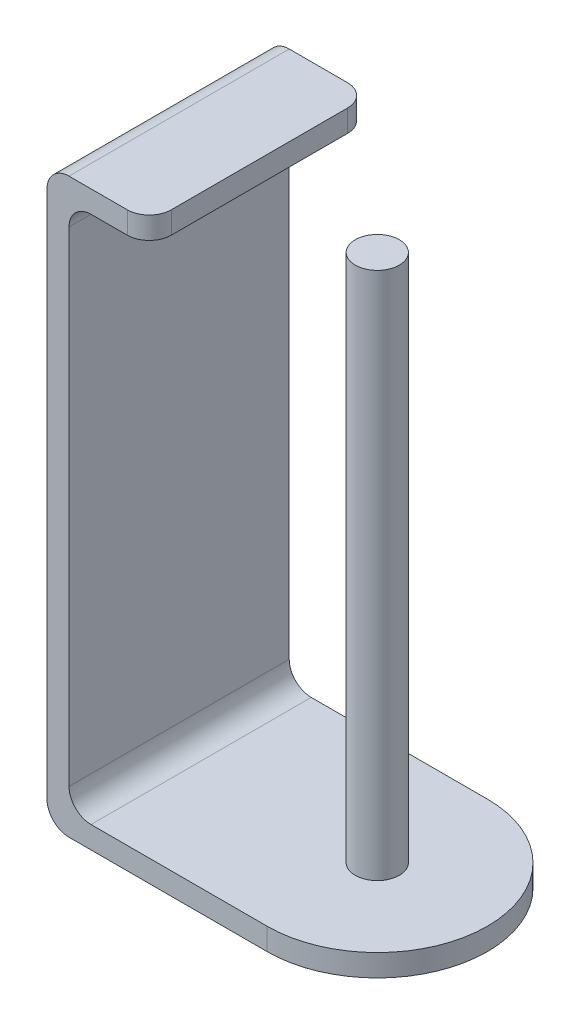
ISO-10303-21;
HEADER;
FILE_DESCRIPTION(('STEP AP214'),'2;1');
FILE_NAME('part.step','',(''),(''),'','','');
FILE_SCHEMA(('AUTOMOTIVE_DESIGN { 1 0 10303 214 1 1 1 1 }'));
ENDSEC;
DATA;
#1=APPLICATION_CONTEXT('core data for automotive mechanical design processes');
#2=APPLICATION_PROTOCOL_DEFINITION('international standard','automotive_design',2000,#1);
#3=PRODUCT_CONTEXT('',#1,'mechanical');
#4=PRODUCT('Part','Part','',(#3));
#5=PRODUCT_RELATED_PRODUCT_CATEGORY('part','',(#4));
#6=PRODUCT_DEFINITION_FORMATION('','',#4);
#7=PRODUCT_DEFINITION_CONTEXT('part definition',#1,'design');
#8=PRODUCT_DEFINITION('design','',#6,#7);
#9=PRODUCT_DEFINITION_SHAPE('','',#8);
#10=(LENGTH_UNIT() NAMED_UNIT(*) SI_UNIT(.MILLI.,.METRE.));
#11=(NAMED_UNIT(*) PLANE_ANGLE_UNIT() SI_UNIT($,.RADIAN.));
#12=(NAMED_UNIT(*) SI_UNIT($,.STERADIAN.) SOLID_ANGLE_UNIT());
#13=UNCERTAINTY_MEASURE_WITH_UNIT(LENGTH_MEASURE(1.E-05),#10,'distance_accuracy_value','');
#14=(GEOMETRIC_REPRESENTATION_CONTEXT(3) GLOBAL_UNCERTAINTY_ASSIGNED_CONTEXT((#13)) GLOBAL_UNIT_ASSIGNED_CONTEXT((#10,
#11,#12)) REPRESENTATION_CONTEXT('',''));
#15=CARTESIAN_POINT('',(0.,0.,0.));
#16=DIRECTION('',(0.,0.,1.));
#17=DIRECTION('',(1.,0.,0.));
#18=AXIS2_PLACEMENT_3D('',#15,#16,#17);
#19=CARTESIAN_POINT('',(127.,12.7,0.));
#20=DIRECTION('',(0.,1.,0.));
#21=DIRECTION('',(0.,0.,1.));
#22=AXIS2_PLACEMENT_3D('',#19,#20,#21);
#23=PLANE('',#22);
#24=DIRECTION('',(-1.,0.,0.));
#25=VECTOR('',#24,1.);
#26=CARTESIAN_POINT('',(127.,12.7,-63.5));
#27=LINE('',#26,#25);
#28=CARTESIAN_POINT('',(127.,12.7,-63.5));
#29=VERTEX_POINT('',#28);
#30=CARTESIAN_POINT('',(25.4,12.7,-63.5));
#31=VERTEX_POINT('',#30);
#32=EDGE_CURVE('E156',#29,#31,#27,.T.);
#33=ORIENTED_EDGE('',*,*,#32,.T.);
#34=DIRECTION('',(0.,0.,-1.));
#35=VECTOR('',#34,1.);
#36=CARTESIAN_POINT('',(25.4,12.7,0.));
#37=LINE('',#36,#35);
#38=CARTESIAN_POINT('',(25.4,12.7,63.5));
#39=VERTEX_POINT('',#38);
#40=EDGE_CURVE('E183',#31,#39,#37,.F.);
#41=ORIENTED_EDGE('',*,*,#40,.T.);
#42=DIRECTION('',(1.,0.,0.));
#43=VECTOR('',#42,1.);
#44=CARTESIAN_POINT('',(0.,12.7,63.5));
#45=LINE('',#44,#43);
#46=CARTESIAN_POINT('',(127.,12.7,63.5));
#47=VERTEX_POINT('',#46);
#48=EDGE_CURVE('E210',#39,#47,#45,.T.);
#49=ORIENTED_EDGE('',*,*,#48,.T.);
#50=CARTESIAN_POINT('',(127.,12.7,0.));
#51=DIRECTION('',(0.,1.,0.));
#52=DIRECTION('',(0.,0.,1.));
#53=AXIS2_PLACEMENT_3D('',#50,#51,#52);
#54=CIRCLE('',#53,63.5);
#55=EDGE_CURVE('E145',#47,#29,#54,.T.);
#56=ORIENTED_EDGE('',*,*,#55,.T.);
#57=EDGE_LOOP('',(#33,#41,#49,#56));
#58=FACE_BOUND('',#57,.T.);
#59=CARTESIAN_POINT('',(127.,12.7,0.));
#60=DIRECTION('',(0.,1.,0.));
#61=DIRECTION('',(0.,0.,1.));
#62=AXIS2_PLACEMENT_3D('',#59,#60,#61);
#63=CIRCLE('',#62,12.7);
#64=CARTESIAN_POINT('',(127.,12.7,12.7));
#65=VERTEX_POINT('',#64);
#66=EDGE_CURVE('E256',#65,#65,#63,.T.);
#67=ORIENTED_EDGE('',*,*,#66,.F.);
#68=EDGE_LOOP('',(#67));
#69=FACE_BOUND('',#68,.T.);
#70=ADVANCED_FACE('F24',(#58,#69),#23,.T.);
#71=CARTESIAN_POINT('',(0.,12.7,63.5));
#72=DIRECTION('',(0.,0.,-1.));
#73=DIRECTION('',(-1.,0.,0.));
#74=AXIS2_PLACEMENT_3D('',#71,#72,#73);
#75=PLANE('',#74);
#76=DIRECTION('',(0.,-1.,0.));
#77=VECTOR('',#76,1.);
#78=CARTESIAN_POINT('',(0.,12.7,63.5));
#79=LINE('',#78,#77);
#80=CARTESIAN_POINT('',(0.,317.5,63.5));
#81=VERTEX_POINT('',#80);
#82=CARTESIAN_POINT('',(0.,12.7,63.5));
#83=VERTEX_POINT('',#82);
#84=EDGE_CURVE('E160',#81,#83,#79,.T.);
#85=ORIENTED_EDGE('',*,*,#84,.T.);
#86=CARTESIAN_POINT('',(12.7,12.7,63.5));
#87=DIRECTION('',(0.,0.,-1.));
#88=DIRECTION('',(-1.,0.,0.));
#89=AXIS2_PLACEMENT_3D('',#86,#87,#88);
#90=CIRCLE('',#89,12.7);
#91=CARTESIAN_POINT('',(12.7,0.,63.5));
#92=VERTEX_POINT('',#91);
#93=EDGE_CURVE('E133',#83,#92,#90,.F.);
#94=ORIENTED_EDGE('',*,*,#93,.T.);
#95=DIRECTION('',(1.,0.,0.));
#96=VECTOR('',#95,1.);
#97=CARTESIAN_POINT('',(0.,0.,63.5));
#98=LINE('',#97,#96);
#99=CARTESIAN_POINT('',(127.,0.,63.5));
#100=VERTEX_POINT('',#99);
#101=EDGE_CURVE('E127',#92,#100,#98,.T.);
#102=ORIENTED_EDGE('',*,*,#101,.T.);
#103=DIRECTION('',(0.,-1.,0.));
#104=VECTOR('',#103,1.);
#105=CARTESIAN_POINT('',(127.,12.7,63.5));
#106=LINE('',#105,#104);
#107=EDGE_CURVE('E132',#47,#100,#106,.T.);
#108=ORIENTED_EDGE('',*,*,#107,.F.);
#109=ORIENTED_EDGE('',*,*,#48,.F.);
#110=CARTESIAN_POINT('',(25.4,25.4,63.5));
#111=DIRECTION('',(0.,0.,-1.));
#112=DIRECTION('',(-1.,0.,0.));
#113=AXIS2_PLACEMENT_3D('',#110,#111,#112);
#114=CIRCLE('',#113,12.7);
#115=CARTESIAN_POINT('',(12.7,25.4000000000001,63.5));
#116=VERTEX_POINT('',#115);
#117=EDGE_CURVE('E11',#39,#116,#114,.T.);
#118=ORIENTED_EDGE('',*,*,#117,.T.);
#119=DIRECTION('',(0.,-1.,0.));
#120=VECTOR('',#119,1.);
#121=CARTESIAN_POINT('',(12.7,317.5,63.5));
#122=LINE('',#121,#120);
#123=CARTESIAN_POINT('',(12.7,304.8,63.5));
#124=VERTEX_POINT('',#123);
#125=EDGE_CURVE('E135',#124,#116,#122,.T.);
#126=ORIENTED_EDGE('',*,*,#125,.F.);
#127=CARTESIAN_POINT('',(25.4,304.8,63.5));
#128=DIRECTION('',(0.,0.,-1.));
#129=DIRECTION('',(-1.,0.,0.));
#130=AXIS2_PLACEMENT_3D('',#127,#128,#129);
#131=CIRCLE('',#130,12.7);
#132=CARTESIAN_POINT('',(25.4,317.5,63.5));
#133=VERTEX_POINT('',#132);
#134=EDGE_CURVE('E207',#124,#133,#131,.T.);
#135=ORIENTED_EDGE('',*,*,#134,.T.);
#136=DIRECTION('',(1.,0.,0.));
#137=VECTOR('',#136,1.);
#138=CARTESIAN_POINT('',(0.,317.5,63.5));
#139=LINE('',#138,#137);
#140=CARTESIAN_POINT('',(46.2941901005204,317.5,63.5));
#141=VERTEX_POINT('',#140);
#142=EDGE_CURVE('E248',#133,#141,#139,.T.);
#143=ORIENTED_EDGE('',*,*,#142,.T.);
#144=DIRECTION('',(0.,-1.,0.));
#145=VECTOR('',#144,1.);
#146=CARTESIAN_POINT('',(46.2941901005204,12.7,63.5));
#147=LINE('',#146,#145);
#148=CARTESIAN_POINT('',(46.2941901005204,330.2,63.5));
#149=VERTEX_POINT('',#148);
#150=EDGE_CURVE('E244',#141,#149,#147,.F.);
#151=ORIENTED_EDGE('',*,*,#150,.T.);
#152=DIRECTION('',(1.,0.,0.));
#153=VECTOR('',#152,1.);
#154=CARTESIAN_POINT('',(0.,330.2,63.5));
#155=LINE('',#154,#153);
#156=CARTESIAN_POINT('',(12.7,330.2,63.5));
#157=VERTEX_POINT('',#156);
#158=EDGE_CURVE('E220',#157,#149,#155,.T.);
#159=ORIENTED_EDGE('',*,*,#158,.F.);
#160=CARTESIAN_POINT('',(12.7,317.5,63.5));
#161=DIRECTION('',(0.,0.,-1.));
#162=DIRECTION('',(-1.,0.,0.));
#163=AXIS2_PLACEMENT_3D('',#160,#161,#162);
#164=CIRCLE('',#163,12.7);
#165=EDGE_CURVE('E180',#157,#81,#164,.F.);
#166=ORIENTED_EDGE('',*,*,#165,.T.);
#167=EDGE_LOOP('',(#85,#94,#102,#108,#109,#118,#126,#135,#143,#151,#159,#166));
#168=FACE_BOUND('',#167,.T.);
#169=ADVANCED_FACE('F26',(#168),#75,.F.);
#170=CARTESIAN_POINT('',(127.,12.7,0.));
#171=DIRECTION('',(0.,-1.,0.));
#172=DIRECTION('',(0.,0.,-1.));
#173=AXIS2_PLACEMENT_3D('',#170,#171,#172);
#174=CYLINDRICAL_SURFACE('',#173,63.5);
#175=CARTESIAN_POINT('',(127.,0.,0.));
#176=DIRECTION('',(0.,1.,0.));
#177=DIRECTION('',(0.,0.,1.));
#178=AXIS2_PLACEMENT_3D('',#175,#176,#177);
#179=CIRCLE('',#178,63.5);
#180=CARTESIAN_POINT('',(127.,0.,-63.5));
#181=VERTEX_POINT('',#180);
#182=EDGE_CURVE('E134',#100,#181,#179,.T.);
#183=ORIENTED_EDGE('',*,*,#182,.T.);
#184=DIRECTION('',(0.,-1.,0.));
#185=VECTOR('',#184,1.);
#186=CARTESIAN_POINT('',(127.,12.7,-63.5));
#187=LINE('',#186,#185);
#188=EDGE_CURVE('E147',#29,#181,#187,.T.);
#189=ORIENTED_EDGE('',*,*,#188,.F.);
#190=ORIENTED_EDGE('',*,*,#55,.F.);
#191=ORIENTED_EDGE('',*,*,#107,.T.);
#192=EDGE_LOOP('',(#183,#189,#190,#191));
#193=FACE_BOUND('',#192,.T.);
#194=ADVANCED_FACE('F144',(#193),#174,.T.);
#195=CARTESIAN_POINT('',(127.,12.7,-63.5));
#196=DIRECTION('',(0.,0.,1.));
#197=DIRECTION('',(1.,0.,0.));
#198=AXIS2_PLACEMENT_3D('',#195,#196,#197);
#199=PLANE('',#198);
#200=DIRECTION('',(-1.,0.,0.));
#201=VECTOR('',#200,1.);
#202=CARTESIAN_POINT('',(127.,0.,-63.5));
#203=LINE('',#202,#201);
#204=CARTESIAN_POINT('',(12.7,0.,-63.5));
#205=VERTEX_POINT('',#204);
#206=EDGE_CURVE('E138',#181,#205,#203,.T.);
#207=ORIENTED_EDGE('',*,*,#206,.T.);
#208=CARTESIAN_POINT('',(12.7,12.7,-63.5));
#209=DIRECTION('',(0.,0.,1.));
#210=DIRECTION('',(1.,0.,0.));
#211=AXIS2_PLACEMENT_3D('',#208,#209,#210);
#212=CIRCLE('',#211,12.7);
#213=CARTESIAN_POINT('',(0.,12.7,-63.5));
#214=VERTEX_POINT('',#213);
#215=EDGE_CURVE('E179',#205,#214,#212,.F.);
#216=ORIENTED_EDGE('',*,*,#215,.T.);
#217=DIRECTION('',(0.,-1.,0.));
#218=VECTOR('',#217,1.);
#219=CARTESIAN_POINT('',(0.,12.7,-63.5));
#220=LINE('',#219,#218);
#221=CARTESIAN_POINT('',(0.,317.5,-63.5));
#222=VERTEX_POINT('',#221);
#223=EDGE_CURVE('E152',#222,#214,#220,.T.);
#224=ORIENTED_EDGE('',*,*,#223,.F.);
#225=CARTESIAN_POINT('',(12.7,317.5,-63.5));
#226=DIRECTION('',(0.,0.,1.));
#227=DIRECTION('',(1.,0.,0.));
#228=AXIS2_PLACEMENT_3D('',#225,#226,#227);
#229=CIRCLE('',#228,12.7);
#230=CARTESIAN_POINT('',(12.7,330.2,-63.5));
#231=VERTEX_POINT('',#230);
#232=EDGE_CURVE('E39',#222,#231,#229,.F.);
#233=ORIENTED_EDGE('',*,*,#232,.T.);
#234=DIRECTION('',(-1.,0.,0.));
#235=VECTOR('',#234,1.);
#236=CARTESIAN_POINT('',(58.9941901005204,330.2,-63.5));
#237=LINE('',#236,#235);
#238=CARTESIAN_POINT('',(46.2941901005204,330.2,-63.5));
#239=VERTEX_POINT('',#238);
#240=EDGE_CURVE('E215',#239,#231,#237,.T.);
#241=ORIENTED_EDGE('',*,*,#240,.F.);
#242=DIRECTION('',(0.,-1.,0.));
#243=VECTOR('',#242,1.);
#244=CARTESIAN_POINT('',(46.2941901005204,12.7,-63.5));
#245=LINE('',#244,#243);
#246=CARTESIAN_POINT('',(46.2941901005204,317.5,-63.5));
#247=VERTEX_POINT('',#246);
#248=EDGE_CURVE('E146',#239,#247,#245,.T.);
#249=ORIENTED_EDGE('',*,*,#248,.T.);
#250=DIRECTION('',(-1.,0.,0.));
#251=VECTOR('',#250,1.);
#252=CARTESIAN_POINT('',(58.9941901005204,317.5,-63.5));
#253=LINE('',#252,#251);
#254=CARTESIAN_POINT('',(25.4,317.5,-63.5));
#255=VERTEX_POINT('',#254);
#256=EDGE_CURVE('E222',#247,#255,#253,.T.);
#257=ORIENTED_EDGE('',*,*,#256,.T.);
#258=CARTESIAN_POINT('',(25.4,304.8,-63.5));
#259=DIRECTION('',(0.,0.,1.));
#260=DIRECTION('',(1.,0.,0.));
#261=AXIS2_PLACEMENT_3D('',#258,#259,#260);
#262=CIRCLE('',#261,12.7);
#263=CARTESIAN_POINT('',(12.7,304.8,-63.5));
#264=VERTEX_POINT('',#263);
#265=EDGE_CURVE('E410',#255,#264,#262,.T.);
#266=ORIENTED_EDGE('',*,*,#265,.T.);
#267=DIRECTION('',(0.,-1.,0.));
#268=VECTOR('',#267,1.);
#269=CARTESIAN_POINT('',(12.7,317.5,-63.5));
#270=LINE('',#269,#268);
#271=CARTESIAN_POINT('',(12.7,25.4000000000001,-63.5));
#272=VERTEX_POINT('',#271);
#273=EDGE_CURVE('E197',#264,#272,#270,.T.);
#274=ORIENTED_EDGE('',*,*,#273,.T.);
#275=CARTESIAN_POINT('',(25.4,25.4,-63.5));
#276=DIRECTION('',(0.,0.,1.));
#277=DIRECTION('',(1.,0.,0.));
#278=AXIS2_PLACEMENT_3D('',#275,#276,#277);
#279=CIRCLE('',#278,12.7);
#280=EDGE_CURVE('E32',#272,#31,#279,.T.);
#281=ORIENTED_EDGE('',*,*,#280,.T.);
#282=ORIENTED_EDGE('',*,*,#32,.F.);
#283=ORIENTED_EDGE('',*,*,#188,.T.);
#284=EDGE_LOOP('',(#207,#216,#224,#233,#241,#249,#257,#266,#274,#281,#282,#283));
#285=FACE_BOUND('',#284,.T.);
#286=ADVANCED_FACE('F195',(#285),#199,.F.);
#287=CARTESIAN_POINT('',(0.,12.7,-63.5));
#288=DIRECTION('',(1.,0.,0.));
#289=DIRECTION('',(0.,0.,-1.));
#290=AXIS2_PLACEMENT_3D('',#287,#288,#289);
#291=PLANE('',#290);
#292=ORIENTED_EDGE('',*,*,#223,.T.);
#293=DIRECTION('',(0.,0.,1.));
#294=VECTOR('',#293,1.);
#295=CARTESIAN_POINT('',(0.,12.7,-63.5));
#296=LINE('',#295,#294);
#297=EDGE_CURVE('E173',#214,#83,#296,.T.);
#298=ORIENTED_EDGE('',*,*,#297,.T.);
#299=ORIENTED_EDGE('',*,*,#84,.F.);
#300=DIRECTION('',(0.,0.,1.));
#301=VECTOR('',#300,1.);
#302=CARTESIAN_POINT('',(0.,317.5,-63.5));
#303=LINE('',#302,#301);
#304=EDGE_CURVE('E175',#81,#222,#303,.F.);
#305=ORIENTED_EDGE('',*,*,#304,.T.);
#306=EDGE_LOOP('',(#292,#298,#299,#305));
#307=FACE_BOUND('',#306,.T.);
#308=ADVANCED_FACE('F171',(#307),#291,.F.);
#309=CARTESIAN_POINT('',(127.,0.,0.));
#310=DIRECTION('',(0.,1.,0.));
#311=DIRECTION('',(0.,0.,1.));
#312=AXIS2_PLACEMENT_3D('',#309,#310,#311);
#313=PLANE('',#312);
#314=ORIENTED_EDGE('',*,*,#101,.F.);
#315=DIRECTION('',(0.,0.,1.));
#316=VECTOR('',#315,1.);
#317=CARTESIAN_POINT('',(12.7,0.,0.));
#318=LINE('',#317,#316);
#319=EDGE_CURVE('E47',#92,#205,#318,.F.);
#320=ORIENTED_EDGE('',*,*,#319,.T.);
#321=ORIENTED_EDGE('',*,*,#206,.F.);
#322=ORIENTED_EDGE('',*,*,#182,.F.);
#323=EDGE_LOOP('',(#314,#320,#321,#322));
#324=FACE_BOUND('',#323,.T.);
#325=ADVANCED_FACE('F137',(#324),#313,.F.);
#326=CARTESIAN_POINT('',(12.7,317.5,-63.5));
#327=DIRECTION('',(-1.,0.,0.));
#328=DIRECTION('',(0.,0.,1.));
#329=AXIS2_PLACEMENT_3D('',#326,#327,#328);
#330=PLANE('',#329);
#331=ORIENTED_EDGE('',*,*,#125,.T.);
#332=DIRECTION('',(0.,0.,-1.));
#333=VECTOR('',#332,1.);
#334=CARTESIAN_POINT('',(12.7,25.4,-63.5));
#335=LINE('',#334,#333);
#336=EDGE_CURVE('E206',#116,#272,#335,.T.);
#337=ORIENTED_EDGE('',*,*,#336,.T.);
#338=ORIENTED_EDGE('',*,*,#273,.F.);
#339=DIRECTION('',(0.,0.,-1.));
#340=VECTOR('',#339,1.);
#341=CARTESIAN_POINT('',(12.7,304.8,63.5));
#342=LINE('',#341,#340);
#343=EDGE_CURVE('E409',#264,#124,#342,.F.);
#344=ORIENTED_EDGE('',*,*,#343,.T.);
#345=EDGE_LOOP('',(#331,#337,#338,#344));
#346=FACE_BOUND('',#345,.T.);
#347=ADVANCED_FACE('F315',(#346),#330,.F.);
#348=CARTESIAN_POINT('',(58.9941901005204,317.5,63.5));
#349=DIRECTION('',(0.,1.,0.));
#350=DIRECTION('',(0.,0.,1.));
#351=AXIS2_PLACEMENT_3D('',#348,#349,#350);
#352=PLANE('',#351);
#353=ORIENTED_EDGE('',*,*,#142,.F.);
#354=DIRECTION('',(0.,0.,-1.));
#355=VECTOR('',#354,1.);
#356=CARTESIAN_POINT('',(25.4,317.5,-63.5));
#357=LINE('',#356,#355);
#358=EDGE_CURVE('E247',#133,#255,#357,.T.);
#359=ORIENTED_EDGE('',*,*,#358,.T.);
#360=ORIENTED_EDGE('',*,*,#256,.F.);
#361=CARTESIAN_POINT('',(46.2941901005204,317.5,-50.8));
#362=DIRECTION('',(0.,1.,0.));
#363=DIRECTION('',(0.,0.,1.));
#364=AXIS2_PLACEMENT_3D('',#361,#362,#363);
#365=CIRCLE('',#364,12.7);
#366=CARTESIAN_POINT('',(58.9941901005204,317.5,-50.8));
#367=VERTEX_POINT('',#366);
#368=EDGE_CURVE('E233',#247,#367,#365,.F.);
#369=ORIENTED_EDGE('',*,*,#368,.T.);
#370=DIRECTION('',(0.,0.,-1.));
#371=VECTOR('',#370,1.);
#372=CARTESIAN_POINT('',(58.9941901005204,317.5,63.5));
#373=LINE('',#372,#371);
#374=CARTESIAN_POINT('',(58.9941901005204,317.5,50.8));
#375=VERTEX_POINT('',#374);
#376=EDGE_CURVE('E225',#375,#367,#373,.T.);
#377=ORIENTED_EDGE('',*,*,#376,.F.);
#378=CARTESIAN_POINT('',(46.2941901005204,317.5,50.8));
#379=DIRECTION('',(0.,1.,0.));
#380=DIRECTION('',(0.,0.,1.));
#381=AXIS2_PLACEMENT_3D('',#378,#379,#380);
#382=CIRCLE('',#381,12.7);
#383=EDGE_CURVE('E150',#375,#141,#382,.F.);
#384=ORIENTED_EDGE('',*,*,#383,.T.);
#385=EDGE_LOOP('',(#353,#359,#360,#369,#377,#384));
#386=FACE_BOUND('',#385,.T.);
#387=ADVANCED_FACE('F288',(#386),#352,.F.);
#388=CARTESIAN_POINT('',(58.9941901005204,330.2,63.5));
#389=DIRECTION('',(-1.,0.,0.));
#390=DIRECTION('',(0.,0.,1.));
#391=AXIS2_PLACEMENT_3D('',#388,#389,#390);
#392=PLANE('',#391);
#393=ORIENTED_EDGE('',*,*,#376,.T.);
#394=DIRECTION('',(0.,-1.,0.));
#395=VECTOR('',#394,1.);
#396=CARTESIAN_POINT('',(58.9941901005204,330.2,-50.8));
#397=LINE('',#396,#395);
#398=CARTESIAN_POINT('',(58.9941901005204,330.2,-50.8));
#399=VERTEX_POINT('',#398);
#400=EDGE_CURVE('E238',#367,#399,#397,.F.);
#401=ORIENTED_EDGE('',*,*,#400,.T.);
#402=DIRECTION('',(0.,0.,-1.));
#403=VECTOR('',#402,1.);
#404=CARTESIAN_POINT('',(58.9941901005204,330.2,63.5));
#405=LINE('',#404,#403);
#406=CARTESIAN_POINT('',(58.9941901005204,330.2,50.8));
#407=VERTEX_POINT('',#406);
#408=EDGE_CURVE('E217',#407,#399,#405,.T.);
#409=ORIENTED_EDGE('',*,*,#408,.F.);
#410=DIRECTION('',(0.,-1.,0.));
#411=VECTOR('',#410,1.);
#412=CARTESIAN_POINT('',(58.9941901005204,330.2,50.8));
#413=LINE('',#412,#411);
#414=EDGE_CURVE('E235',#407,#375,#413,.T.);
#415=ORIENTED_EDGE('',*,*,#414,.T.);
#416=EDGE_LOOP('',(#393,#401,#409,#415));
#417=FACE_BOUND('',#416,.T.);
#418=ADVANCED_FACE('F283',(#417),#392,.F.);
#419=CARTESIAN_POINT('',(58.9941901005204,330.2,63.5));
#420=DIRECTION('',(0.,1.,0.));
#421=DIRECTION('',(0.,0.,1.));
#422=AXIS2_PLACEMENT_3D('',#419,#420,#421);
#423=PLANE('',#422);
#424=ORIENTED_EDGE('',*,*,#240,.T.);
#425=DIRECTION('',(0.,0.,1.));
#426=VECTOR('',#425,1.);
#427=CARTESIAN_POINT('',(12.7,330.2,63.5));
#428=LINE('',#427,#426);
#429=EDGE_CURVE('E191',#231,#157,#428,.T.);
#430=ORIENTED_EDGE('',*,*,#429,.T.);
#431=ORIENTED_EDGE('',*,*,#158,.T.);
#432=CARTESIAN_POINT('',(46.2941901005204,330.2,50.8));
#433=DIRECTION('',(0.,1.,0.));
#434=DIRECTION('',(0.,0.,1.));
#435=AXIS2_PLACEMENT_3D('',#432,#433,#434);
#436=CIRCLE('',#435,12.7);
#437=EDGE_CURVE('E240',#149,#407,#436,.T.);
#438=ORIENTED_EDGE('',*,*,#437,.T.);
#439=ORIENTED_EDGE('',*,*,#408,.T.);
#440=CARTESIAN_POINT('',(46.2941901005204,330.2,-50.8));
#441=DIRECTION('',(0.,1.,0.));
#442=DIRECTION('',(0.,0.,1.));
#443=AXIS2_PLACEMENT_3D('',#440,#441,#442);
#444=CIRCLE('',#443,12.7);
#445=EDGE_CURVE('E242',#399,#239,#444,.T.);
#446=ORIENTED_EDGE('',*,*,#445,.T.);
#447=EDGE_LOOP('',(#424,#430,#431,#438,#439,#446));
#448=FACE_BOUND('',#447,.T.);
#449=ADVANCED_FACE('F287',(#448),#423,.T.);
#450=CARTESIAN_POINT('',(46.2941901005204,12.7,-50.8));
#451=DIRECTION('',(0.,-1.,0.));
#452=DIRECTION('',(0.,0.,-1.));
#453=AXIS2_PLACEMENT_3D('',#450,#451,#452);
#454=CYLINDRICAL_SURFACE('',#453,12.7);
#455=ORIENTED_EDGE('',*,*,#445,.F.);
#456=ORIENTED_EDGE('',*,*,#400,.F.);
#457=ORIENTED_EDGE('',*,*,#368,.F.);
#458=ORIENTED_EDGE('',*,*,#248,.F.);
#459=EDGE_LOOP('',(#455,#456,#457,#458));
#460=FACE_BOUND('',#459,.T.);
#461=ADVANCED_FACE('F295',(#460),#454,.T.);
#462=CARTESIAN_POINT('',(46.2941901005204,330.2,50.8));
#463=DIRECTION('',(0.,-1.,0.));
#464=DIRECTION('',(0.,0.,-1.));
#465=AXIS2_PLACEMENT_3D('',#462,#463,#464);
#466=CYLINDRICAL_SURFACE('',#465,12.7);
#467=ORIENTED_EDGE('',*,*,#437,.F.);
#468=ORIENTED_EDGE('',*,*,#150,.F.);
#469=ORIENTED_EDGE('',*,*,#383,.F.);
#470=ORIENTED_EDGE('',*,*,#414,.F.);
#471=EDGE_LOOP('',(#467,#468,#469,#470));
#472=FACE_BOUND('',#471,.T.);
#473=ADVANCED_FACE('F299',(#472),#466,.T.);
#474=CARTESIAN_POINT('',(25.4,304.8,63.5));
#475=DIRECTION('',(0.,0.,1.));
#476=DIRECTION('',(1.,0.,0.));
#477=AXIS2_PLACEMENT_3D('',#474,#475,#476);
#478=CYLINDRICAL_SURFACE('',#477,12.7);
#479=ORIENTED_EDGE('',*,*,#134,.F.);
#480=ORIENTED_EDGE('',*,*,#343,.F.);
#481=ORIENTED_EDGE('',*,*,#265,.F.);
#482=ORIENTED_EDGE('',*,*,#358,.F.);
#483=EDGE_LOOP('',(#479,#480,#481,#482));
#484=FACE_BOUND('',#483,.T.);
#485=ADVANCED_FACE('F307',(#484),#478,.F.);
#486=CARTESIAN_POINT('',(25.4,25.4,-63.5));
#487=DIRECTION('',(0.,0.,-1.));
#488=DIRECTION('',(-1.,0.,0.));
#489=AXIS2_PLACEMENT_3D('',#486,#487,#488);
#490=CYLINDRICAL_SURFACE('',#489,12.7);
#491=ORIENTED_EDGE('',*,*,#117,.F.);
#492=ORIENTED_EDGE('',*,*,#40,.F.);
#493=ORIENTED_EDGE('',*,*,#280,.F.);
#494=ORIENTED_EDGE('',*,*,#336,.F.);
#495=EDGE_LOOP('',(#491,#492,#493,#494));
#496=FACE_BOUND('',#495,.T.);
#497=ADVANCED_FACE('F205',(#496),#490,.F.);
#498=CARTESIAN_POINT('',(12.7,12.7,-63.5));
#499=DIRECTION('',(0.,0.,1.));
#500=DIRECTION('',(1.,0.,0.));
#501=AXIS2_PLACEMENT_3D('',#498,#499,#500);
#502=CYLINDRICAL_SURFACE('',#501,12.7);
#503=ORIENTED_EDGE('',*,*,#215,.F.);
#504=ORIENTED_EDGE('',*,*,#319,.F.);
#505=ORIENTED_EDGE('',*,*,#93,.F.);
#506=ORIENTED_EDGE('',*,*,#297,.F.);
#507=EDGE_LOOP('',(#503,#504,#505,#506));
#508=FACE_BOUND('',#507,.T.);
#509=ADVANCED_FACE('F178',(#508),#502,.T.);
#510=CARTESIAN_POINT('',(12.7,317.5,63.5));
#511=DIRECTION('',(0.,0.,-1.));
#512=DIRECTION('',(-1.,0.,0.));
#513=AXIS2_PLACEMENT_3D('',#510,#511,#512);
#514=CYLINDRICAL_SURFACE('',#513,12.7);
#515=ORIENTED_EDGE('',*,*,#232,.F.);
#516=ORIENTED_EDGE('',*,*,#304,.F.);
#517=ORIENTED_EDGE('',*,*,#165,.F.);
#518=ORIENTED_EDGE('',*,*,#429,.F.);
#519=EDGE_LOOP('',(#515,#516,#517,#518));
#520=FACE_BOUND('',#519,.T.);
#521=ADVANCED_FACE('F367',(#520),#514,.T.);
#522=CARTESIAN_POINT('',(127.,353.421024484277,0.));
#523=DIRECTION('',(0.,-1.,0.));
#524=DIRECTION('',(0.,0.,-1.));
#525=AXIS2_PLACEMENT_3D('',#522,#523,#524);
#526=CYLINDRICAL_SURFACE('',#525,12.7);
#527=ORIENTED_EDGE('',*,*,#66,.T.);
#528=EDGE_LOOP('',(#527));
#529=FACE_BOUND('',#528,.T.);
#530=CARTESIAN_POINT('',(127.,317.5,0.));
#531=DIRECTION('',(0.,1.,0.));
#532=DIRECTION('',(0.,0.,1.));
#533=AXIS2_PLACEMENT_3D('',#530,#531,#532);
#534=CIRCLE('',#533,12.7);
#535=CARTESIAN_POINT('',(127.,317.5,12.7));
#536=VERTEX_POINT('',#535);
#537=EDGE_CURVE('E250',#536,#536,#534,.T.);
#538=ORIENTED_EDGE('',*,*,#537,.F.);
#539=EDGE_LOOP('',(#538));
#540=FACE_BOUND('',#539,.T.);
#541=ADVANCED_FACE('F260',(#529,#540),#526,.T.);
#542=CARTESIAN_POINT('',(58.9941901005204,317.5,63.5));
#543=DIRECTION('',(0.,1.,0.));
#544=DIRECTION('',(0.,0.,1.));
#545=AXIS2_PLACEMENT_3D('',#542,#543,#544);
#546=PLANE('',#545);
#547=ORIENTED_EDGE('',*,*,#537,.T.);
#548=EDGE_LOOP('',(#547));
#549=FACE_BOUND('',#548,.T.);
#550=ADVANCED_FACE('F383',(#549),#546,.T.);
#551=CLOSED_SHELL('',(#70,#169,#194,#286,#308,#325,#347,#387,#418,#449,#461,#473,#485,#497,#509,
#521,#541,#550));
#552=MANIFOLD_SOLID_BREP('B2',#551);
#553=ADVANCED_BREP_SHAPE_REPRESENTATION('',(#18,#552),#14);
#554=SHAPE_DEFINITION_REPRESENTATION(#9,#553);
ENDSEC;
END-ISO-10303-21;
